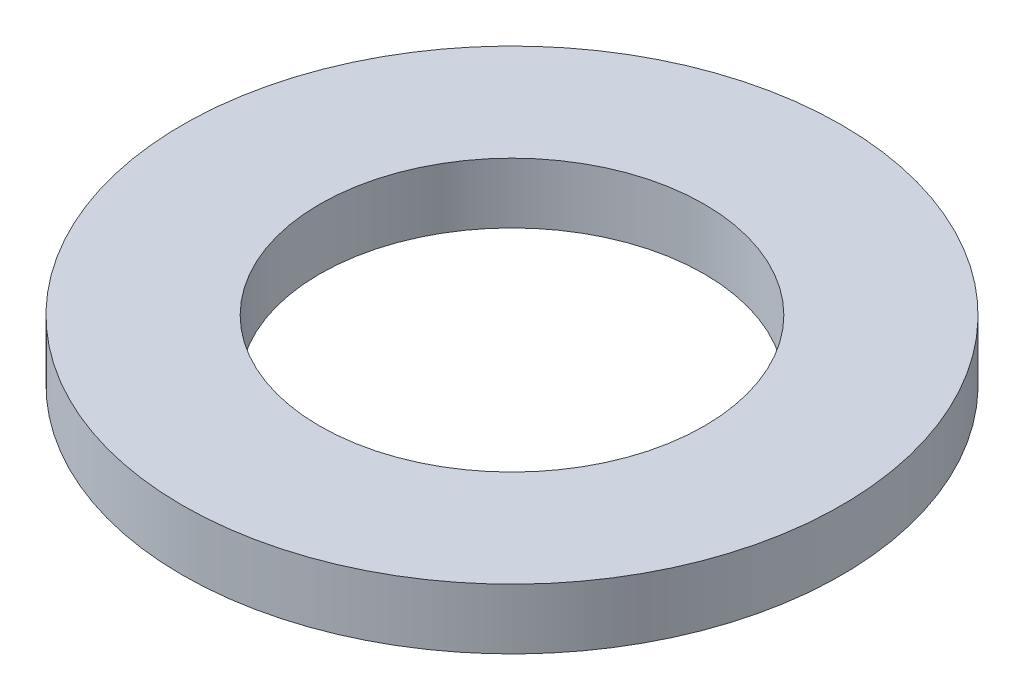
from build123d import *

# Parameters (mm, degrees)
ESQUISSE1_R      = 12
ESQUISSE1_R_2    = 7
EXTRUSION1_DEPTH = 2.2


with BuildPart() as part:
    # Esquisse1 → Extrusion1 (new body)
    with BuildSketch(Plane(origin=(0, 0, 0), x_dir=(1, 0, 0), z_dir=(0, 1, 0))):
        with Locations(Location((0, 0, 0), (0, 0, 270))):
            Circle(ESQUISSE1_R)
        with Locations(Location((0, 0, 0), (0, 0, 270))):
            Circle(ESQUISSE1_R_2, mode=Mode.SUBTRACT)
    extrude(amount=EXTRUSION1_DEPTH)


solid = part.part
